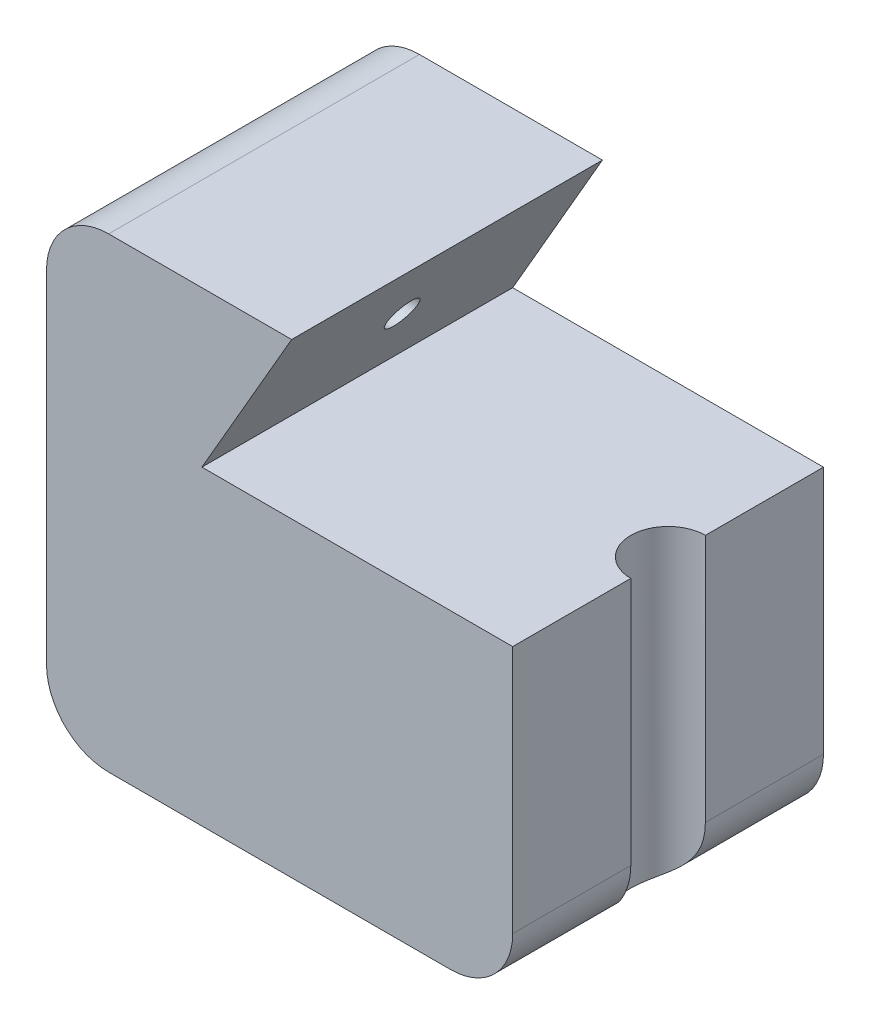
ISO-10303-21;
HEADER;
FILE_DESCRIPTION(('STEP AP214'),'2;1');
FILE_NAME('part.step','',(''),(''),'','','');
FILE_SCHEMA(('AUTOMOTIVE_DESIGN { 1 0 10303 214 1 1 1 1 }'));
ENDSEC;
DATA;
#1=APPLICATION_CONTEXT('core data for automotive mechanical design processes');
#2=APPLICATION_PROTOCOL_DEFINITION('international standard','automotive_design',2000,#1);
#3=PRODUCT_CONTEXT('',#1,'mechanical');
#4=PRODUCT('Part','Part','',(#3));
#5=PRODUCT_RELATED_PRODUCT_CATEGORY('part','',(#4));
#6=PRODUCT_DEFINITION_FORMATION('','',#4);
#7=PRODUCT_DEFINITION_CONTEXT('part definition',#1,'design');
#8=PRODUCT_DEFINITION('design','',#6,#7);
#9=PRODUCT_DEFINITION_SHAPE('','',#8);
#10=(LENGTH_UNIT() NAMED_UNIT(*) SI_UNIT(.MILLI.,.METRE.));
#11=(NAMED_UNIT(*) PLANE_ANGLE_UNIT() SI_UNIT($,.RADIAN.));
#12=(NAMED_UNIT(*) SI_UNIT($,.STERADIAN.) SOLID_ANGLE_UNIT());
#13=UNCERTAINTY_MEASURE_WITH_UNIT(LENGTH_MEASURE(1.E-05),#10,'distance_accuracy_value','');
#14=(GEOMETRIC_REPRESENTATION_CONTEXT(3) GLOBAL_UNCERTAINTY_ASSIGNED_CONTEXT((#13)) GLOBAL_UNIT_ASSIGNED_CONTEXT((#10,
#11,#12)) REPRESENTATION_CONTEXT('',''));
#15=CARTESIAN_POINT('',(0.,0.,0.));
#16=DIRECTION('',(0.,0.,1.));
#17=DIRECTION('',(1.,0.,0.));
#18=AXIS2_PLACEMENT_3D('',#15,#16,#17);
#19=CARTESIAN_POINT('',(75.0000000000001,50.,50.));
#20=DIRECTION('',(-1.,0.,0.));
#21=DIRECTION('',(0.,-1.,0.));
#22=AXIS2_PLACEMENT_3D('',#19,#20,#21);
#23=PLANE('',#22);
#24=DIRECTION('',(0.,0.,-1.));
#25=VECTOR('',#24,1.);
#26=CARTESIAN_POINT('',(75.,10.,50.));
#27=LINE('',#26,#25);
#28=CARTESIAN_POINT('',(75.,10.,50.));
#29=VERTEX_POINT('',#28);
#30=CARTESIAN_POINT('',(75.,10.,31.));
#31=VERTEX_POINT('',#30);
#32=EDGE_CURVE('E138',#29,#31,#27,.T.);
#33=ORIENTED_EDGE('',*,*,#32,.T.);
#34=DIRECTION('',(0.,1.,0.));
#35=VECTOR('',#34,1.);
#36=CARTESIAN_POINT('',(75.,-16.9705627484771,31.));
#37=LINE('',#36,#35);
#38=CARTESIAN_POINT('',(75.0000000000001,50.,31.));
#39=VERTEX_POINT('',#38);
#40=EDGE_CURVE('E126',#31,#39,#37,.T.);
#41=ORIENTED_EDGE('',*,*,#40,.T.);
#42=DIRECTION('',(0.,0.,-1.));
#43=VECTOR('',#42,1.);
#44=CARTESIAN_POINT('',(75.0000000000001,50.,50.));
#45=LINE('',#44,#43);
#46=CARTESIAN_POINT('',(75.0000000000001,50.,50.));
#47=VERTEX_POINT('',#46);
#48=EDGE_CURVE('E135',#47,#39,#45,.T.);
#49=ORIENTED_EDGE('',*,*,#48,.F.);
#50=DIRECTION('',(0.,1.,0.));
#51=VECTOR('',#50,1.);
#52=CARTESIAN_POINT('',(75.0000000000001,50.,50.));
#53=LINE('',#52,#51);
#54=EDGE_CURVE('E234',#29,#47,#53,.T.);
#55=ORIENTED_EDGE('',*,*,#54,.F.);
#56=EDGE_LOOP('',(#33,#41,#49,#55));
#57=FACE_BOUND('',#56,.T.);
#58=ADVANCED_FACE('F43',(#57),#23,.F.);
#59=CARTESIAN_POINT('',(10.,10.,50.));
#60=DIRECTION('',(0.,0.,-1.));
#61=DIRECTION('',(-1.,0.,0.));
#62=AXIS2_PLACEMENT_3D('',#59,#60,#61);
#63=CYLINDRICAL_SURFACE('',#62,10.);
#64=CARTESIAN_POINT('',(10.,10.,0.));
#65=DIRECTION('',(0.,0.,1.));
#66=DIRECTION('',(1.,0.,0.));
#67=AXIS2_PLACEMENT_3D('',#64,#65,#66);
#68=CIRCLE('',#67,10.);
#69=CARTESIAN_POINT('',(0.,10.0000000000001,0.));
#70=VERTEX_POINT('',#69);
#71=CARTESIAN_POINT('',(10.0000000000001,0.,0.));
#72=VERTEX_POINT('',#71);
#73=EDGE_CURVE('E139',#70,#72,#68,.T.);
#74=ORIENTED_EDGE('',*,*,#73,.T.);
#75=DIRECTION('',(0.,0.,-1.));
#76=VECTOR('',#75,1.);
#77=CARTESIAN_POINT('',(10.0000000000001,0.,50.));
#78=LINE('',#77,#76);
#79=CARTESIAN_POINT('',(10.0000000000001,0.,50.));
#80=VERTEX_POINT('',#79);
#81=EDGE_CURVE('E51',#80,#72,#78,.T.);
#82=ORIENTED_EDGE('',*,*,#81,.F.);
#83=CARTESIAN_POINT('',(10.,10.,50.));
#84=DIRECTION('',(0.,0.,1.));
#85=DIRECTION('',(1.,0.,0.));
#86=AXIS2_PLACEMENT_3D('',#83,#84,#85);
#87=CIRCLE('',#86,10.);
#88=CARTESIAN_POINT('',(0.,10.0000000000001,50.));
#89=VERTEX_POINT('',#88);
#90=EDGE_CURVE('E195',#89,#80,#87,.T.);
#91=ORIENTED_EDGE('',*,*,#90,.F.);
#92=DIRECTION('',(0.,0.,-1.));
#93=VECTOR('',#92,1.);
#94=CARTESIAN_POINT('',(0.,10.0000000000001,50.));
#95=LINE('',#94,#93);
#96=EDGE_CURVE('E169',#89,#70,#95,.T.);
#97=ORIENTED_EDGE('',*,*,#96,.T.);
#98=EDGE_LOOP('',(#74,#82,#91,#97));
#99=FACE_BOUND('',#98,.T.);
#100=ADVANCED_FACE('F45',(#99),#63,.T.);
#101=CARTESIAN_POINT('',(64.9999999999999,0.,50.));
#102=DIRECTION('',(0.,1.,0.));
#103=DIRECTION('',(-1.,0.,0.));
#104=AXIS2_PLACEMENT_3D('',#101,#102,#103);
#105=PLANE('',#104);
#106=DIRECTION('',(1.,0.,0.));
#107=VECTOR('',#106,1.);
#108=CARTESIAN_POINT('',(64.9999999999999,0.,0.));
#109=LINE('',#108,#107);
#110=CARTESIAN_POINT('',(64.9999999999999,0.,0.));
#111=VERTEX_POINT('',#110);
#112=EDGE_CURVE('E161',#72,#111,#109,.T.);
#113=ORIENTED_EDGE('',*,*,#112,.T.);
#114=DIRECTION('',(0.,0.,-1.));
#115=VECTOR('',#114,1.);
#116=CARTESIAN_POINT('',(64.9999999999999,0.,50.));
#117=LINE('',#116,#115);
#118=CARTESIAN_POINT('',(64.9999999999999,0.,50.));
#119=VERTEX_POINT('',#118);
#120=EDGE_CURVE('E153',#119,#111,#117,.T.);
#121=ORIENTED_EDGE('',*,*,#120,.F.);
#122=DIRECTION('',(1.,0.,0.));
#123=VECTOR('',#122,1.);
#124=CARTESIAN_POINT('',(64.9999999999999,0.,50.));
#125=LINE('',#124,#123);
#126=EDGE_CURVE('E162',#80,#119,#125,.T.);
#127=ORIENTED_EDGE('',*,*,#126,.F.);
#128=ORIENTED_EDGE('',*,*,#81,.T.);
#129=EDGE_LOOP('',(#113,#121,#127,#128));
#130=FACE_BOUND('',#129,.T.);
#131=ADVANCED_FACE('F159',(#130),#105,.F.);
#132=CARTESIAN_POINT('',(65.,9.99999999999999,50.));
#133=DIRECTION('',(0.,0.,-1.));
#134=DIRECTION('',(-1.,0.,0.));
#135=AXIS2_PLACEMENT_3D('',#132,#133,#134);
#136=CYLINDRICAL_SURFACE('',#135,10.);
#137=CARTESIAN_POINT('',(75.,10.,19.));
#138=VERTEX_POINT('',#137);
#139=CARTESIAN_POINT('',(75.,10.,0.));
#140=VERTEX_POINT('',#139);
#141=EDGE_CURVE('E145',#138,#140,#27,.T.);
#142=ORIENTED_EDGE('',*,*,#141,.F.);
#143=CARTESIAN_POINT('',(75.,10.,19.));
#144=CARTESIAN_POINT('',(74.999999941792,9.87347024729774,19.0000045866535));
#145=CARTESIAN_POINT('',(74.9975982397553,9.74695283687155,18.9999994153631));
#146=CARTESIAN_POINT('',(74.9879965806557,9.49410073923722,19.0000092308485));
#147=CARTESIAN_POINT('',(74.9807966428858,9.36776605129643,19.0000242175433));
#148=CARTESIAN_POINT('',(74.9520108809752,8.98932267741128,19.0001589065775));
#149=CARTESIAN_POINT('',(74.92323910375,8.73772332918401,19.0003683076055));
#150=CARTESIAN_POINT('',(74.8464336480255,8.23572044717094,19.0018423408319));
#151=CARTESIAN_POINT('',(74.7982676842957,7.98533732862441,19.0031142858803));
#152=CARTESIAN_POINT('',(74.6829601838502,7.48898473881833,19.0081044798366));
#153=CARTESIAN_POINT('',(74.6158176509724,7.24301549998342,19.0118228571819));
#154=CARTESIAN_POINT('',(74.4548948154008,6.73131883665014,19.024210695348));
#155=CARTESIAN_POINT('',(74.3590501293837,6.46624826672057,19.0333615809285));
#156=CARTESIAN_POINT('',(74.1454682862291,5.94541870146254,19.0601891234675));
#157=CARTESIAN_POINT('',(74.0277260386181,5.68966188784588,19.0778677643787));
#158=CARTESIAN_POINT('',(73.7721039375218,5.19079569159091,19.1255542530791));
#159=CARTESIAN_POINT('',(73.634301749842,4.94764222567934,19.155515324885));
#160=CARTESIAN_POINT('',(73.3401796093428,4.47563887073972,19.2321534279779));
#161=CARTESIAN_POINT('',(73.1838718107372,4.2467797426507,19.278819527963));
#162=CARTESIAN_POINT('',(72.9146765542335,3.885348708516,19.3729388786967));
#163=CARTESIAN_POINT('',(72.8063470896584,3.74770606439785,19.4140947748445));
#164=CARTESIAN_POINT('',(72.584415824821,3.48027698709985,19.5064226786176));
#165=CARTESIAN_POINT('',(72.4708156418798,3.35048817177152,19.55759162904));
#166=CARTESIAN_POINT('',(72.2397397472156,3.09962031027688,19.6710678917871));
#167=CARTESIAN_POINT('',(72.12226602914,2.97853688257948,19.7333695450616));
#168=CARTESIAN_POINT('',(71.8850425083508,2.74577372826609,19.870109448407));
#169=CARTESIAN_POINT('',(71.7652926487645,2.63409423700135,19.94454800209));
#170=CARTESIAN_POINT('',(71.5244260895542,2.41989031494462,20.1069784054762));
#171=CARTESIAN_POINT('',(71.4033065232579,2.31745337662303,20.1950818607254));
#172=CARTESIAN_POINT('',(71.1629621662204,2.12334062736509,20.3847462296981));
#173=CARTESIAN_POINT('',(71.0437373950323,2.03166492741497,20.4863072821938));
#174=CARTESIAN_POINT('',(70.8095838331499,1.85936937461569,20.7028116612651));
#175=CARTESIAN_POINT('',(70.694653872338,1.77874649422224,20.8177513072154));
#176=CARTESIAN_POINT('',(70.4714334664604,1.62852939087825,21.060550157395));
#177=CARTESIAN_POINT('',(70.3631421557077,1.55893372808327,21.1884076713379));
#178=CARTESIAN_POINT('',(70.1691455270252,1.43897311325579,21.4384709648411));
#179=CARTESIAN_POINT('',(70.0823453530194,1.38728239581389,21.5591967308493));
#180=CARTESIAN_POINT('',(69.9167420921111,1.29168269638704,21.8089296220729));
#181=CARTESIAN_POINT('',(69.8379386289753,1.2477733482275,21.9379363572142));
#182=CARTESIAN_POINT('',(69.6894873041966,1.16734237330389,22.2032930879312));
#183=CARTESIAN_POINT('',(69.6198387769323,1.13082020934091,22.3396425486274));
#184=CARTESIAN_POINT('',(69.4906539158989,1.064716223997,22.6186681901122));
#185=CARTESIAN_POINT('',(69.4311176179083,1.03513442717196,22.7613443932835));
#186=CARTESIAN_POINT('',(69.3250832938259,0.983515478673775,23.0461599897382));
#187=CARTESIAN_POINT('',(69.2781619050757,0.961225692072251,23.1880963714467));
#188=CARTESIAN_POINT('',(69.1948833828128,0.922276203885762,23.4758408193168));
#189=CARTESIAN_POINT('',(69.1585297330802,0.905618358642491,23.6216501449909));
#190=CARTESIAN_POINT('',(69.0968082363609,0.877647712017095,23.916051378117));
#191=CARTESIAN_POINT('',(69.0714385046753,0.866333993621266,24.0646428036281));
#192=CARTESIAN_POINT('',(69.0319390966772,0.848828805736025,24.3636143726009));
#193=CARTESIAN_POINT('',(69.0178098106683,0.842637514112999,24.5139945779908));
#194=CARTESIAN_POINT('',(69.0007945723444,0.835190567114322,24.8180492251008));
#195=CARTESIAN_POINT('',(68.9981014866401,0.834019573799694,24.9717365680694));
#196=CARTESIAN_POINT('',(69.0045145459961,0.836819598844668,25.2788186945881));
#197=CARTESIAN_POINT('',(69.0136207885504,0.840790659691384,25.4322134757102));
#198=CARTESIAN_POINT('',(69.0435391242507,0.853959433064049,25.7376457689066));
#199=CARTESIAN_POINT('',(69.0643522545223,0.863157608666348,25.8896831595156));
#200=CARTESIAN_POINT('',(69.1174630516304,0.886968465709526,26.1913047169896));
#201=CARTESIAN_POINT('',(69.1497603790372,0.901580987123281,26.3408889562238));
#202=CARTESIAN_POINT('',(69.2256799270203,0.936590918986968,26.6373005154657));
#203=CARTESIAN_POINT('',(69.2693597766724,0.957017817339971,26.7841096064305));
#204=CARTESIAN_POINT('',(69.3674355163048,1.00397536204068,27.0730368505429));
#205=CARTESIAN_POINT('',(69.4218272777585,1.03050365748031,27.2151567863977));
#206=CARTESIAN_POINT('',(69.5406639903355,1.09007380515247,27.4937073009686));
#207=CARTESIAN_POINT('',(69.6051083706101,1.1231152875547,27.6301382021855));
#208=CARTESIAN_POINT('',(69.7432108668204,1.19613451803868,27.8963160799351));
#209=CARTESIAN_POINT('',(69.8168688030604,1.23611213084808,28.0260631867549));
#210=CARTESIAN_POINT('',(69.9711743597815,1.32272354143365,28.2759954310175));
#211=CARTESIAN_POINT('',(70.0516956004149,1.36924427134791,28.3962978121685));
#212=CARTESIAN_POINT('',(70.2195578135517,1.46971399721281,28.6287637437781));
#213=CARTESIAN_POINT('',(70.3068986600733,1.5236628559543,28.7409274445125));
#214=CARTESIAN_POINT('',(70.4871258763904,1.63920454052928,28.9564757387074));
#215=CARTESIAN_POINT('',(70.5800111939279,1.700795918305,29.0598619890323));
#216=CARTESIAN_POINT('',(70.7699900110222,1.83173698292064,29.2574405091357));
#217=CARTESIAN_POINT('',(70.8670835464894,1.90108673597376,29.3516327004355));
#218=CARTESIAN_POINT('',(71.0639593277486,2.04742685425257,29.5304802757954));
#219=CARTESIAN_POINT('',(71.1637381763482,2.12440786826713,29.6151470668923));
#220=CARTESIAN_POINT('',(71.3647095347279,2.28591612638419,29.7750556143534));
#221=CARTESIAN_POINT('',(71.4659020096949,2.37044318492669,29.8502976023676));
#222=CARTESIAN_POINT('',(71.6683992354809,2.54678085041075,29.9915609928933));
#223=CARTESIAN_POINT('',(71.7697040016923,2.63859262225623,30.0575809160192));
#224=CARTESIAN_POINT('',(71.9712092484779,2.82912252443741,30.1807701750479));
#225=CARTESIAN_POINT('',(72.0714095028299,2.92784204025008,30.2379377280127));
#226=CARTESIAN_POINT('',(72.3024276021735,3.16550487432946,30.3614807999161));
#227=CARTESIAN_POINT('',(72.4324036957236,3.30694777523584,30.424642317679));
#228=CARTESIAN_POINT('',(72.6863316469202,3.60015943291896,30.5377139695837));
#229=CARTESIAN_POINT('',(72.8102818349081,3.75193102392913,30.5876204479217));
#230=CARTESIAN_POINT('',(73.0506807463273,4.06488933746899,30.675965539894));
#231=CARTESIAN_POINT('',(73.1671162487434,4.22609175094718,30.7143843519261));
#232=CARTESIAN_POINT('',(73.3910089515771,4.55657835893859,30.7814191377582));
#233=CARTESIAN_POINT('',(73.4984640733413,4.72586441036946,30.8100328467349));
#234=CARTESIAN_POINT('',(73.7327135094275,5.12082122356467,30.8662053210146));
#235=CARTESIAN_POINT('',(73.8562712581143,5.34879202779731,30.8911309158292));
#236=CARTESIAN_POINT('',(74.0855907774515,5.81437671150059,30.931054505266));
#237=CARTESIAN_POINT('',(74.1913468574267,6.05199364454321,30.9460493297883));
#238=CARTESIAN_POINT('',(74.3841527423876,6.53512468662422,30.9691006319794));
#239=CARTESIAN_POINT('',(74.4711942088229,6.78064226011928,30.9771540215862));
#240=CARTESIAN_POINT('',(74.6258578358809,7.27775835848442,30.9888262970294));
#241=CARTESIAN_POINT('',(74.6934848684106,7.52935534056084,30.9924462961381));
#242=CARTESIAN_POINT('',(74.7925536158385,7.96512302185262,30.9965539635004));
#243=CARTESIAN_POINT('',(74.8288191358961,8.14820888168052,30.997638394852));
#244=CARTESIAN_POINT('',(74.8910489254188,8.51610473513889,30.9990914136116));
#245=CARTESIAN_POINT('',(74.9170148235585,8.70091445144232,30.9994601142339));
#246=CARTESIAN_POINT('',(74.9585037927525,9.07113580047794,30.9998942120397));
#247=CARTESIAN_POINT('',(74.9740581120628,9.25654393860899,30.9999605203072));
#248=CARTESIAN_POINT('',(74.9948097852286,9.62796741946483,30.9999990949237));
#249=CARTESIAN_POINT('',(75.0000055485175,9.81398285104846,30.9999713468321));
#250=CARTESIAN_POINT('',(75.,10.,31.));
#251=B_SPLINE_CURVE_WITH_KNOTS('',3,(#143,#144,#145,#146,#147,#148,#149,#150,#151,#152,#153,
#154,#155,#156,#157,#158,#159,#160,#161,#162,#163,#164,#165,#166,#167,#168,#169,#170,#171,#172,
#173,#174,#175,#176,#177,#178,#179,#180,#181,#182,#183,#184,#185,#186,#187,#188,#189,#190,#191,
#192,#193,#194,#195,#196,#197,#198,#199,#200,#201,#202,#203,#204,#205,#206,#207,#208,#209,#210,
#211,#212,#213,#214,#215,#216,#217,#218,#219,#220,#221,#222,#223,#224,#225,#226,#227,#228,#229,
#230,#231,#232,#233,#234,#235,#236,#237,#238,#239,#240,#241,#242,#243,#244,#245,#246,#247,#248,
#249,#250),.UNSPECIFIED.,.F.,.F.,(4,2,2,2,2,2,2,2,2,2,2,2,2,2,2,2,2,2,2,2,2,2,2,2,2,2,2,2,2,2,2,
2,2,2,2,2,2,2,2,2,2,2,2,2,2,2,2,2,2,2,2,2,2,4),(0.,0.379541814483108,0.759082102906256,
1.51800902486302,2.28220263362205,3.04643636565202,3.89138332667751,4.73652695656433,
5.57848143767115,6.41988597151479,6.95921661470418,7.49838284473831,8.0372757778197,
8.57618219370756,9.11974747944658,9.6633183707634,10.2067400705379,10.7500907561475,
11.2217529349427,11.693392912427,12.1649985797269,12.636605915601,13.0895143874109,
13.5425719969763,13.9955518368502,14.4485474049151,14.9091529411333,15.3697622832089,
15.8304124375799,16.2910489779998,16.7540646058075,17.2169021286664,17.6797133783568,
18.1425156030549,18.5981272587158,19.0537304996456,19.5092475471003,19.9647684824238,
20.419737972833,20.8746962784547,21.3297274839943,21.7848502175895,22.3905947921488,
22.996506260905,23.6034562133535,24.2105462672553,24.9909491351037,25.7716010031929,
26.5525999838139,27.333402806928,27.8930685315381,28.4526457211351,29.0105358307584,
29.5685115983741),.UNSPECIFIED.);
#252=EDGE_CURVE('E140',#138,#31,#251,.T.);
#253=ORIENTED_EDGE('',*,*,#252,.T.);
#254=ORIENTED_EDGE('',*,*,#32,.F.);
#255=CARTESIAN_POINT('',(65.,9.99999999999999,50.));
#256=DIRECTION('',(0.,0.,1.));
#257=DIRECTION('',(1.,0.,0.));
#258=AXIS2_PLACEMENT_3D('',#255,#256,#257);
#259=CIRCLE('',#258,10.);
#260=EDGE_CURVE('E236',#119,#29,#259,.T.);
#261=ORIENTED_EDGE('',*,*,#260,.F.);
#262=ORIENTED_EDGE('',*,*,#120,.T.);
#263=CARTESIAN_POINT('',(65.,9.99999999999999,0.));
#264=DIRECTION('',(0.,0.,1.));
#265=DIRECTION('',(1.,0.,0.));
#266=AXIS2_PLACEMENT_3D('',#263,#264,#265);
#267=CIRCLE('',#266,10.);
#268=EDGE_CURVE('E173',#111,#140,#267,.T.);
#269=ORIENTED_EDGE('',*,*,#268,.T.);
#270=EDGE_LOOP('',(#142,#253,#254,#261,#262,#269));
#271=FACE_BOUND('',#270,.T.);
#272=ADVANCED_FACE('F248',(#271),#136,.T.);
#273=CARTESIAN_POINT('',(75.0000000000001,50.,19.));
#274=VERTEX_POINT('',#273);
#275=CARTESIAN_POINT('',(75.0000000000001,50.,0.));
#276=VERTEX_POINT('',#275);
#277=EDGE_CURVE('E146',#274,#276,#45,.T.);
#278=ORIENTED_EDGE('',*,*,#277,.F.);
#279=DIRECTION('',(0.,1.,0.));
#280=VECTOR('',#279,1.);
#281=CARTESIAN_POINT('',(75.,-16.9705627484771,19.));
#282=LINE('',#281,#280);
#283=EDGE_CURVE('E63',#274,#138,#282,.F.);
#284=ORIENTED_EDGE('',*,*,#283,.T.);
#285=ORIENTED_EDGE('',*,*,#141,.T.);
#286=DIRECTION('',(0.,1.,0.));
#287=VECTOR('',#286,1.);
#288=CARTESIAN_POINT('',(75.0000000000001,50.,0.));
#289=LINE('',#288,#287);
#290=EDGE_CURVE('E181',#140,#276,#289,.T.);
#291=ORIENTED_EDGE('',*,*,#290,.T.);
#292=EDGE_LOOP('',(#278,#284,#285,#291));
#293=FACE_BOUND('',#292,.T.);
#294=ADVANCED_FACE('F273',(#293),#23,.F.);
#295=CARTESIAN_POINT('',(25.0000000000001,50.,50.));
#296=DIRECTION('',(0.,-1.,0.));
#297=DIRECTION('',(1.,0.,0.));
#298=AXIS2_PLACEMENT_3D('',#295,#296,#297);
#299=PLANE('',#298);
#300=ORIENTED_EDGE('',*,*,#48,.T.);
#301=CARTESIAN_POINT('',(75.0000000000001,50.,25.));
#302=DIRECTION('',(0.,-1.,0.));
#303=DIRECTION('',(1.,0.,0.));
#304=AXIS2_PLACEMENT_3D('',#301,#302,#303);
#305=CIRCLE('',#304,6.);
#306=EDGE_CURVE('E12',#39,#274,#305,.T.);
#307=ORIENTED_EDGE('',*,*,#306,.T.);
#308=ORIENTED_EDGE('',*,*,#277,.T.);
#309=DIRECTION('',(-1.,0.,0.));
#310=VECTOR('',#309,1.);
#311=CARTESIAN_POINT('',(25.0000000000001,50.,0.));
#312=LINE('',#311,#310);
#313=CARTESIAN_POINT('',(25.0000000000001,50.,0.));
#314=VERTEX_POINT('',#313);
#315=EDGE_CURVE('E184',#276,#314,#312,.T.);
#316=ORIENTED_EDGE('',*,*,#315,.T.);
#317=DIRECTION('',(0.,0.,-1.));
#318=VECTOR('',#317,1.);
#319=CARTESIAN_POINT('',(25.0000000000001,50.,50.));
#320=LINE('',#319,#318);
#321=CARTESIAN_POINT('',(25.0000000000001,50.,50.));
#322=VERTEX_POINT('',#321);
#323=EDGE_CURVE('E149',#322,#314,#320,.T.);
#324=ORIENTED_EDGE('',*,*,#323,.F.);
#325=DIRECTION('',(-1.,0.,0.));
#326=VECTOR('',#325,1.);
#327=CARTESIAN_POINT('',(25.0000000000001,50.,50.));
#328=LINE('',#327,#326);
#329=EDGE_CURVE('E144',#47,#322,#328,.T.);
#330=ORIENTED_EDGE('',*,*,#329,.F.);
#331=EDGE_LOOP('',(#300,#307,#308,#316,#324,#330));
#332=FACE_BOUND('',#331,.T.);
#333=ADVANCED_FACE('F142',(#332),#299,.F.);
#334=CARTESIAN_POINT('',(39.4337567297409,75.,50.));
#335=DIRECTION('',(-0.866025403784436,0.500000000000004,0.));
#336=DIRECTION('',(-0.500000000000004,-0.866025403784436,0.));
#337=AXIS2_PLACEMENT_3D('',#334,#335,#336);
#338=PLANE('',#337);
#339=CARTESIAN_POINT('',(32.2168783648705,62.5,25.));
#340=DIRECTION('',(-0.866025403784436,0.500000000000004,0.));
#341=DIRECTION('',(-0.500000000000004,-0.866025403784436,0.));
#342=AXIS2_PLACEMENT_3D('',#339,#340,#341);
#343=ELLIPSE('',#342,2.88675134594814,2.5);
#344=CARTESIAN_POINT('',(30.7735026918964,60.,25.));
#345=VERTEX_POINT('',#344);
#346=EDGE_CURVE('E369',#345,#345,#343,.T.);
#347=ORIENTED_EDGE('',*,*,#346,.T.);
#348=EDGE_LOOP('',(#347));
#349=FACE_BOUND('',#348,.T.);
#350=DIRECTION('',(0.500000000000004,0.866025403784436,0.));
#351=VECTOR('',#350,1.);
#352=CARTESIAN_POINT('',(39.4337567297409,75.,0.));
#353=LINE('',#352,#351);
#354=CARTESIAN_POINT('',(39.4337567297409,75.,0.));
#355=VERTEX_POINT('',#354);
#356=EDGE_CURVE('E186',#314,#355,#353,.T.);
#357=ORIENTED_EDGE('',*,*,#356,.T.);
#358=DIRECTION('',(0.,0.,-1.));
#359=VECTOR('',#358,1.);
#360=CARTESIAN_POINT('',(39.4337567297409,75.,50.));
#361=LINE('',#360,#359);
#362=CARTESIAN_POINT('',(39.4337567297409,75.,50.));
#363=VERTEX_POINT('',#362);
#364=EDGE_CURVE('E203',#363,#355,#361,.T.);
#365=ORIENTED_EDGE('',*,*,#364,.F.);
#366=DIRECTION('',(0.500000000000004,0.866025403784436,0.));
#367=VECTOR('',#366,1.);
#368=CARTESIAN_POINT('',(39.4337567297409,75.,50.));
#369=LINE('',#368,#367);
#370=EDGE_CURVE('E214',#322,#363,#369,.T.);
#371=ORIENTED_EDGE('',*,*,#370,.F.);
#372=ORIENTED_EDGE('',*,*,#323,.T.);
#373=EDGE_LOOP('',(#357,#365,#371,#372));
#374=FACE_BOUND('',#373,.T.);
#375=ADVANCED_FACE('F213',(#349,#374),#338,.F.);
#376=CARTESIAN_POINT('',(10.0000000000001,75.,50.));
#377=DIRECTION('',(0.,-1.,0.));
#378=DIRECTION('',(1.,0.,0.));
#379=AXIS2_PLACEMENT_3D('',#376,#377,#378);
#380=PLANE('',#379);
#381=DIRECTION('',(-1.,0.,0.));
#382=VECTOR('',#381,1.);
#383=CARTESIAN_POINT('',(10.0000000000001,75.,0.));
#384=LINE('',#383,#382);
#385=CARTESIAN_POINT('',(10.0000000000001,75.,0.));
#386=VERTEX_POINT('',#385);
#387=EDGE_CURVE('E188',#355,#386,#384,.T.);
#388=ORIENTED_EDGE('',*,*,#387,.T.);
#389=DIRECTION('',(0.,0.,-1.));
#390=VECTOR('',#389,1.);
#391=CARTESIAN_POINT('',(10.0000000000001,75.,50.));
#392=LINE('',#391,#390);
#393=CARTESIAN_POINT('',(10.0000000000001,75.,50.));
#394=VERTEX_POINT('',#393);
#395=EDGE_CURVE('E201',#394,#386,#392,.T.);
#396=ORIENTED_EDGE('',*,*,#395,.F.);
#397=DIRECTION('',(-1.,0.,0.));
#398=VECTOR('',#397,1.);
#399=CARTESIAN_POINT('',(10.0000000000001,75.,50.));
#400=LINE('',#399,#398);
#401=EDGE_CURVE('E229',#363,#394,#400,.T.);
#402=ORIENTED_EDGE('',*,*,#401,.F.);
#403=ORIENTED_EDGE('',*,*,#364,.T.);
#404=EDGE_LOOP('',(#388,#396,#402,#403));
#405=FACE_BOUND('',#404,.T.);
#406=ADVANCED_FACE('F220',(#405),#380,.F.);
#407=CARTESIAN_POINT('',(10.,65.,50.));
#408=DIRECTION('',(0.,0.,-1.));
#409=DIRECTION('',(-1.,0.,0.));
#410=AXIS2_PLACEMENT_3D('',#407,#408,#409);
#411=CYLINDRICAL_SURFACE('',#410,10.);
#412=CARTESIAN_POINT('',(10.,65.,0.));
#413=DIRECTION('',(0.,0.,1.));
#414=DIRECTION('',(-1.,0.,0.));
#415=AXIS2_PLACEMENT_3D('',#412,#413,#414);
#416=CIRCLE('',#415,10.);
#417=CARTESIAN_POINT('',(0.,64.9999999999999,0.));
#418=VERTEX_POINT('',#417);
#419=EDGE_CURVE('E190',#386,#418,#416,.T.);
#420=ORIENTED_EDGE('',*,*,#419,.T.);
#421=DIRECTION('',(0.,0.,-1.));
#422=VECTOR('',#421,1.);
#423=CARTESIAN_POINT('',(0.,64.9999999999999,50.));
#424=LINE('',#423,#422);
#425=CARTESIAN_POINT('',(0.,64.9999999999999,25.));
#426=VERTEX_POINT('',#425);
#427=EDGE_CURVE('E197',#426,#418,#424,.T.);
#428=ORIENTED_EDGE('',*,*,#427,.F.);
#429=CARTESIAN_POINT('',(0.,64.9999999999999,50.));
#430=VERTEX_POINT('',#429);
#431=EDGE_CURVE('E198',#430,#426,#424,.T.);
#432=ORIENTED_EDGE('',*,*,#431,.F.);
#433=CARTESIAN_POINT('',(10.,65.,50.));
#434=DIRECTION('',(0.,0.,1.));
#435=DIRECTION('',(-1.,0.,0.));
#436=AXIS2_PLACEMENT_3D('',#433,#434,#435);
#437=CIRCLE('',#436,10.);
#438=EDGE_CURVE('E226',#394,#430,#437,.T.);
#439=ORIENTED_EDGE('',*,*,#438,.F.);
#440=ORIENTED_EDGE('',*,*,#395,.T.);
#441=EDGE_LOOP('',(#420,#428,#432,#439,#440));
#442=FACE_BOUND('',#441,.T.);
#443=ADVANCED_FACE('F223',(#442),#411,.T.);
#444=CARTESIAN_POINT('',(0.,10.0000000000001,50.));
#445=DIRECTION('',(1.,0.,0.));
#446=DIRECTION('',(0.,0.,-1.));
#447=AXIS2_PLACEMENT_3D('',#444,#445,#446);
#448=PLANE('',#447);
#449=ORIENTED_EDGE('',*,*,#431,.T.);
#450=CARTESIAN_POINT('',(0.,62.5,25.));
#451=DIRECTION('',(-1.,0.,0.));
#452=DIRECTION('',(0.,0.,1.));
#453=AXIS2_PLACEMENT_3D('',#450,#451,#452);
#454=CIRCLE('',#453,2.5);
#455=EDGE_CURVE('E56',#426,#426,#454,.T.);
#456=ORIENTED_EDGE('',*,*,#455,.F.);
#457=ORIENTED_EDGE('',*,*,#427,.T.);
#458=DIRECTION('',(0.,-1.,0.));
#459=VECTOR('',#458,1.);
#460=CARTESIAN_POINT('',(0.,10.0000000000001,0.));
#461=LINE('',#460,#459);
#462=EDGE_CURVE('E193',#418,#70,#461,.T.);
#463=ORIENTED_EDGE('',*,*,#462,.T.);
#464=ORIENTED_EDGE('',*,*,#96,.F.);
#465=DIRECTION('',(0.,-1.,0.));
#466=VECTOR('',#465,1.);
#467=CARTESIAN_POINT('',(0.,10.0000000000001,50.));
#468=LINE('',#467,#466);
#469=EDGE_CURVE('E176',#430,#89,#468,.T.);
#470=ORIENTED_EDGE('',*,*,#469,.F.);
#471=EDGE_LOOP('',(#449,#456,#457,#463,#464,#470));
#472=FACE_BOUND('',#471,.T.);
#473=ADVANCED_FACE('F259',(#472),#448,.F.);
#474=CARTESIAN_POINT('',(10.,10.,50.));
#475=DIRECTION('',(0.,0.,1.));
#476=DIRECTION('',(1.,0.,0.));
#477=AXIS2_PLACEMENT_3D('',#474,#475,#476);
#478=PLANE('',#477);
#479=ORIENTED_EDGE('',*,*,#90,.T.);
#480=ORIENTED_EDGE('',*,*,#126,.T.);
#481=ORIENTED_EDGE('',*,*,#260,.T.);
#482=ORIENTED_EDGE('',*,*,#54,.T.);
#483=ORIENTED_EDGE('',*,*,#329,.T.);
#484=ORIENTED_EDGE('',*,*,#370,.T.);
#485=ORIENTED_EDGE('',*,*,#401,.T.);
#486=ORIENTED_EDGE('',*,*,#438,.T.);
#487=ORIENTED_EDGE('',*,*,#469,.T.);
#488=EDGE_LOOP('',(#479,#480,#481,#482,#483,#484,#485,#486,#487));
#489=FACE_BOUND('',#488,.T.);
#490=ADVANCED_FACE('F256',(#489),#478,.T.);
#491=CARTESIAN_POINT('',(10.,10.,0.));
#492=DIRECTION('',(0.,0.,1.));
#493=DIRECTION('',(1.,0.,0.));
#494=AXIS2_PLACEMENT_3D('',#491,#492,#493);
#495=PLANE('',#494);
#496=ORIENTED_EDGE('',*,*,#73,.F.);
#497=ORIENTED_EDGE('',*,*,#462,.F.);
#498=ORIENTED_EDGE('',*,*,#419,.F.);
#499=ORIENTED_EDGE('',*,*,#387,.F.);
#500=ORIENTED_EDGE('',*,*,#356,.F.);
#501=ORIENTED_EDGE('',*,*,#315,.F.);
#502=ORIENTED_EDGE('',*,*,#290,.F.);
#503=ORIENTED_EDGE('',*,*,#268,.F.);
#504=ORIENTED_EDGE('',*,*,#112,.F.);
#505=EDGE_LOOP('',(#496,#497,#498,#499,#500,#501,#502,#503,#504));
#506=FACE_BOUND('',#505,.T.);
#507=ADVANCED_FACE('F216',(#506),#495,.F.);
#508=CARTESIAN_POINT('',(75.0000000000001,-16.9705627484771,25.));
#509=DIRECTION('',(0.,1.,0.));
#510=DIRECTION('',(0.,0.,1.));
#511=AXIS2_PLACEMENT_3D('',#508,#509,#510);
#512=CYLINDRICAL_SURFACE('',#511,6.);
#513=ORIENTED_EDGE('',*,*,#252,.F.);
#514=ORIENTED_EDGE('',*,*,#283,.F.);
#515=ORIENTED_EDGE('',*,*,#306,.F.);
#516=ORIENTED_EDGE('',*,*,#40,.F.);
#517=EDGE_LOOP('',(#513,#514,#515,#516));
#518=FACE_BOUND('',#517,.T.);
#519=ADVANCED_FACE('F125',(#518),#512,.F.);
#520=CARTESIAN_POINT('',(82.0710678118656,62.5,25.));
#521=DIRECTION('',(-1.,0.,0.));
#522=DIRECTION('',(0.,0.,1.));
#523=AXIS2_PLACEMENT_3D('',#520,#521,#522);
#524=CYLINDRICAL_SURFACE('',#523,2.5);
#525=ORIENTED_EDGE('',*,*,#455,.T.);
#526=EDGE_LOOP('',(#525));
#527=FACE_BOUND('',#526,.T.);
#528=ORIENTED_EDGE('',*,*,#346,.F.);
#529=EDGE_LOOP('',(#528));
#530=FACE_BOUND('',#529,.T.);
#531=ADVANCED_FACE('F255',(#527,#530),#524,.F.);
#532=CLOSED_SHELL('',(#58,#100,#131,#272,#294,#333,#375,#406,#443,#473,#490,#507,#519,#531));
#533=MANIFOLD_SOLID_BREP('B2',#532);
#534=ADVANCED_BREP_SHAPE_REPRESENTATION('',(#18,#533),#14);
#535=SHAPE_DEFINITION_REPRESENTATION(#9,#534);
ENDSEC;
END-ISO-10303-21;
